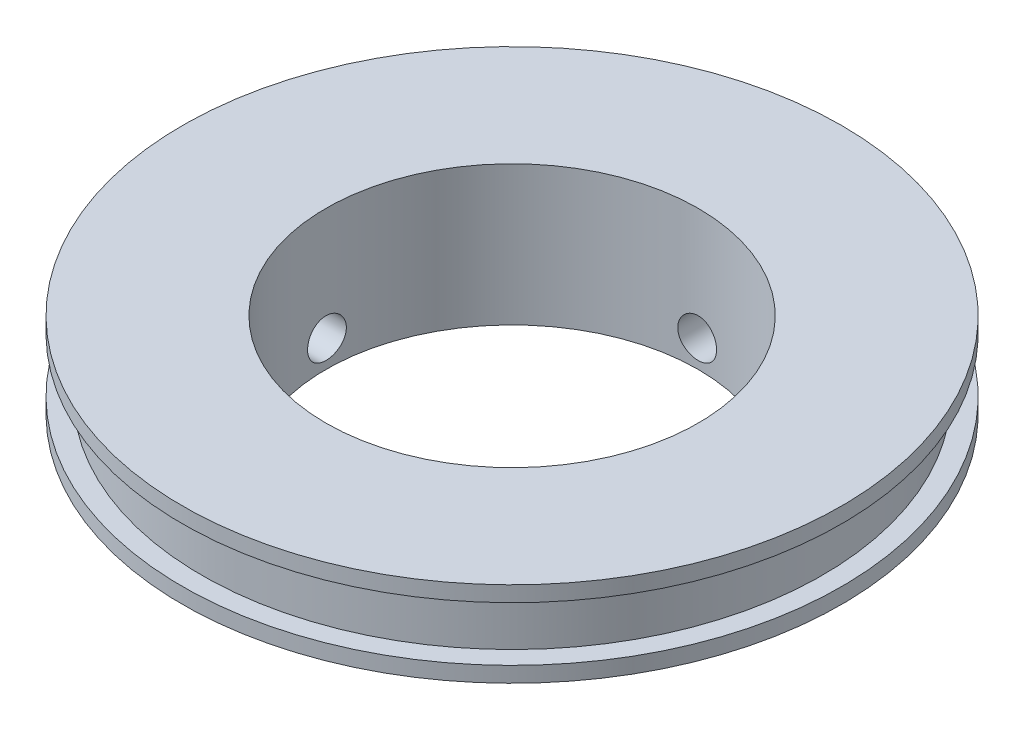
from build123d import *

# Parameters (mm, degrees)
SKETCH2_R          = 2.5
CUT_EXTRUDE1_DEPTH = 62.260968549
SKETCH3_R          = 2.5
CUT_EXTRUDE2_DEPTH = 62.260968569


with BuildPart() as part:
    # Sketch1 → Revolve1 (revolve)
    with BuildSketch(Plane.XY, mode=Mode.PRIVATE) as revolve1_sk:
        Polygon((24, 6.150684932), (42.5, 6.150684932), (42.5, 4.150684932), (40, 4.150684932), (40, -2.849315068), (42.5, -2.849315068), (42.5, -4.849315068), (30, -4.849315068), (30, -11.849315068), (24, -11.849315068), align=None)
    revolve(revolve1_sk.sketch.rotate(Axis((0, 0, 0), (0, 1, 0)), 90), axis=Axis((0, 0, 0), (0, 1, 0)))

    # Sketch2 → Cut-Extrude1 (cut, through all)
    with BuildSketch(Plane.XY):
        with Locations(Location((0, -8.349315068, 0), (0, 0, 270))):
            Circle(SKETCH2_R)
    extrude(amount=-CUT_EXTRUDE1_DEPTH, mode=Mode.SUBTRACT)

    # Sketch3 → Cut-Extrude2 (cut, through all)
    with BuildSketch(Plane(origin=(0, 0, 0), x_dir=(0, 0, -1), z_dir=(1, 0, 0))):
        with Locations((0, -8.349315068)):
            Circle(SKETCH3_R)
    extrude(amount=-CUT_EXTRUDE2_DEPTH, mode=Mode.SUBTRACT)


solid = part.part
